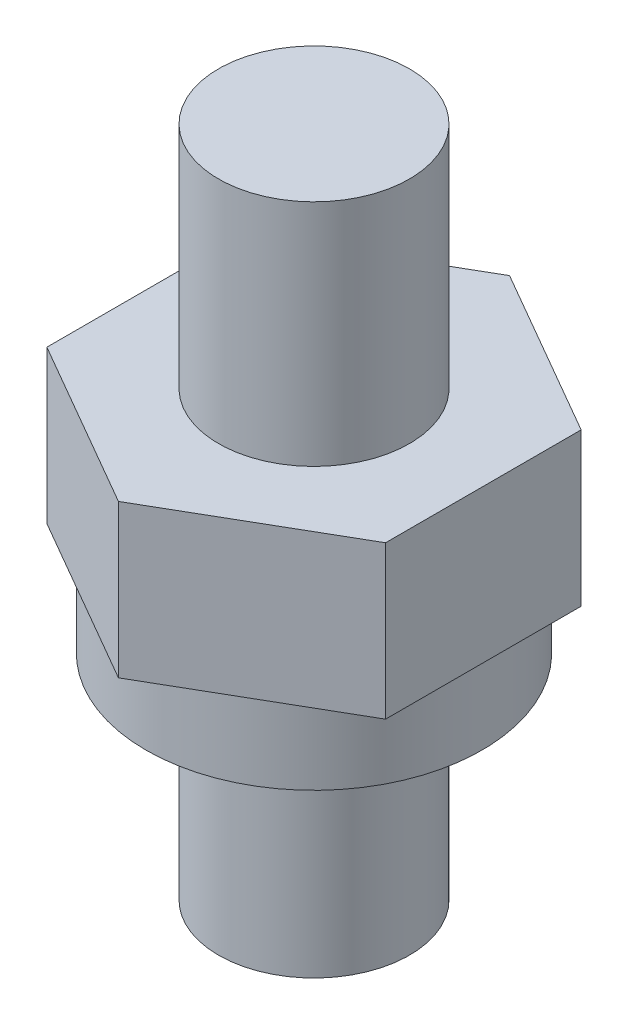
from build123d import *

# Parameters (mm, degrees)
SKETCH1_R      = 3.96875
EXTRUDE1_DEPTH = 8.89
SKETCH2_R      = 6.985
EXTRUDE2_DEPTH = 3.175
EXTRUDE3_DEPTH = 6.35
SKETCH4_R      = 3.96875
EXTRUDE4_DEPTH = 9.525


with BuildPart() as part:
    # Sketch1 → Extrude1 (new body)
    with BuildSketch(Plane(origin=(0, 0, 0), x_dir=(1, 0, 0), z_dir=(0, 1, 0))):
        with Locations(Location((0, 0, 0), (0, 0, 270))):
            Circle(SKETCH1_R)
    extrude(amount=EXTRUDE1_DEPTH)

    # Sketch2 → Extrude2 (add)
    with BuildSketch(Plane(origin=(0, 8.89, 0), x_dir=(1, 0, 0), z_dir=(0, 1, 0))):
        with Locations(Location((0, 0, 0), (0, 0, 270))):
            Circle(SKETCH2_R)
    extrude(amount=EXTRUDE2_DEPTH)

    # Sketch3 → Extrude3 (add)
    with BuildSketch(Plane(origin=(0, 12.065, 0), x_dir=(1, 0, 0), z_dir=(0, 1, 0))):
        Polygon((7.039054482, 4.064), (0, 8.128), (-7.039054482, 4.064), (-7.039054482, -4.064), (0, -8.128), (7.039054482, -4.064), align=None)
    extrude(amount=EXTRUDE3_DEPTH)

    # Sketch4 → Extrude4 (add)
    with BuildSketch(Plane(origin=(0, 18.415, 0), x_dir=(1, 0, 0), z_dir=(0, 1, 0))):
        with Locations(Location((0, 0, 0), (0, 0, 270))):
            Circle(SKETCH4_R)
    extrude(amount=EXTRUDE4_DEPTH)


solid = part.part
